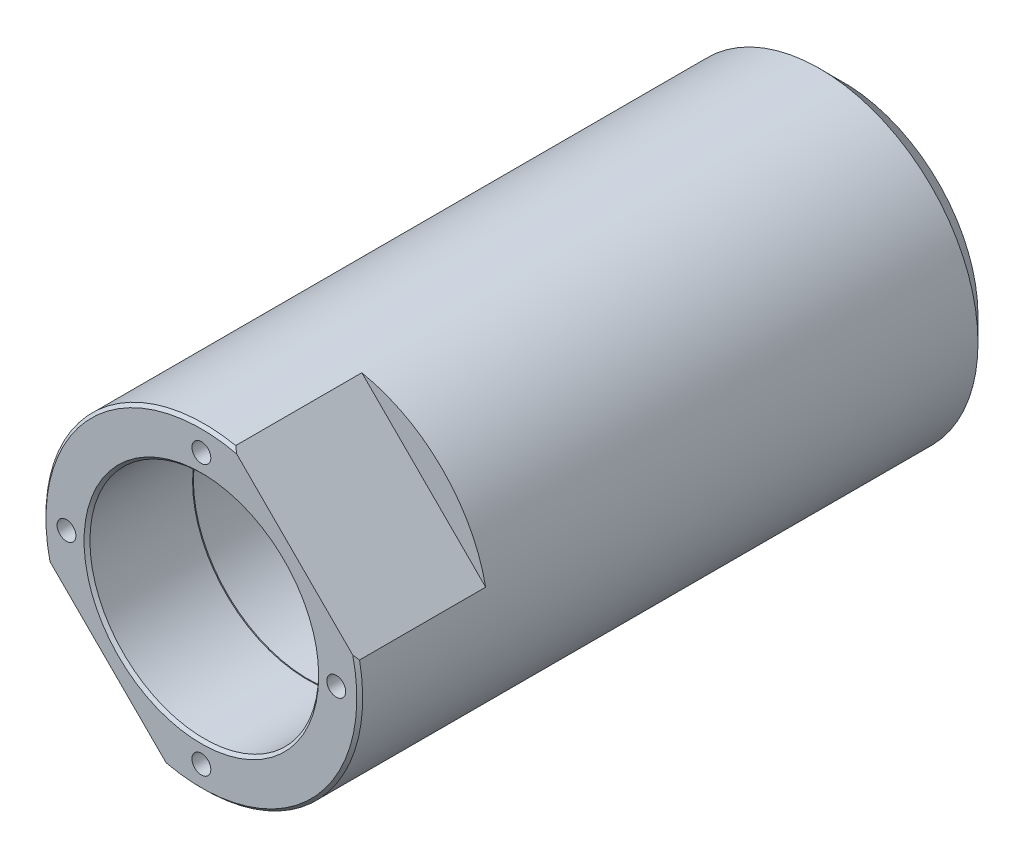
from build123d import *

# Parameters (mm, degrees)
CHAMFER1_SIZE          = 0.79375
F_10_32_TAPPED_HOLE1_D = 4.0386
CIRPATTERN1_COUNT      = 4
CHAMFER2_SIZE          = 0.79375
SKETCH7_OUTSIDE_W      = 130.086
SKETCH7_OUTSIDE_H      = 130.086
CUT_EXTRUDE1_DEPTH     = 34.925
CHAMFER4_SIZE          = 6.35
CHAMFER5_SIZE          = 0.79375


with BuildPart() as part:
    # Sketch1 → Revolve1 (revolve)
    with BuildSketch(Plane(origin=(0, 0, 0), x_dir=(0, 0, -1), z_dir=(1, 0, 0)), mode=Mode.PRIVATE) as revolve1_sk:
        Polygon((28.923929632, 31.08325), (85.376070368, 31.08325), (85.725, 30.95625), (114.3, 30.95625), (114.3, 29), (158.75, 29), (158.75, 20), (173.6725, 20), (173.6725, 42.8625), (0, 42.8625), (0, 30.95625), (28.575, 30.95625), align=None)
    revolve(revolve1_sk.sketch.rotate(Axis((0, 0, 0), (0, 0, 1)), 90), axis=Axis((0, 0, 0), (0, 0, 1)))

    # Chamfer1
    chamfer1_edges = [part.edges().sort_by_distance(p)[0] for p in [
        (20, 0, -173.6725),
    ]]
    chamfer(chamfer1_edges, length=CHAMFER1_SIZE)

    # Sketch2 → 1_4-20 Tapped Hole1 (revolve, cut)
    with BuildSketch(Plane(origin=(0, 36.5125, 0), x_dir=(0, -1, 0), z_dir=(1, 0, 0))):
        Polygon((0, 0), (0, 22.514216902), (2.5527, 20.9804), (2.5527, 0), align=None)
    f_1_4_20_tapped_hole1 = revolve(axis=Axis((0, 36.5125, 6.35), (0, 0, -1)), mode=Mode.SUBTRACT)

    # 10-32 Tapped Hole1 (through all)
    with Locations(Plane(origin=(0, 0, -173.6725), x_dir=(-1, 0, 0), z_dir=(0, 0, -1))):
        with Locations((25, 0)):
            f_10_32_tapped_hole1 = Hole(F_10_32_TAPPED_HOLE1_D / 2)

    # CirPattern1: 1_4-20 Tapped Hole1, 10-32 Tapped Hole1 ×4 about axis
    cirpattern1_axis = Axis((0, 0, 0), (0, 0, 1))
    add([f_1_4_20_tapped_hole1.rotate(cirpattern1_axis, i * 360 / CIRPATTERN1_COUNT) for i in range(1, CIRPATTERN1_COUNT)], mode=Mode.SUBTRACT)
    add([f_10_32_tapped_hole1.rotate(cirpattern1_axis, i * 360 / CIRPATTERN1_COUNT) for i in range(1, CIRPATTERN1_COUNT)], mode=Mode.SUBTRACT)

    # Chamfer2
    chamfer2_edges = [part.edges().sort_by_distance(p)[0] for p in [
        (42.8625, 0, 0),
    ]]
    chamfer(chamfer2_edges, length=CHAMFER2_SIZE)

    # Sketch7 outside → Cut-Extrude1 (cut)
    with BuildSketch(Plane.XY):
        Rectangle(SKETCH7_OUTSIDE_W, SKETCH7_OUTSIDE_H)
        Polygon((-5.051394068, 55.565334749), (55.565334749, -5.051394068), (5.051394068, -55.565334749), (-55.565334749, 5.051394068), align=None, mode=Mode.SUBTRACT)
    extrude(amount=-CUT_EXTRUDE1_DEPTH, mode=Mode.SUBTRACT)

    # Chamfer4
    chamfer4_edges = [part.edges().sort_by_distance(p)[0] for p in [
        (42.8625, 0, -173.6725),
    ]]
    chamfer(chamfer4_edges, length=CHAMFER4_SIZE)

    # Chamfer5
    chamfer5_edges = [part.edges().sort_by_distance(p)[0] for p in [
        (30.95625, 0, 0),
    ]]
    chamfer(chamfer5_edges, length=CHAMFER5_SIZE)


solid = part.part
